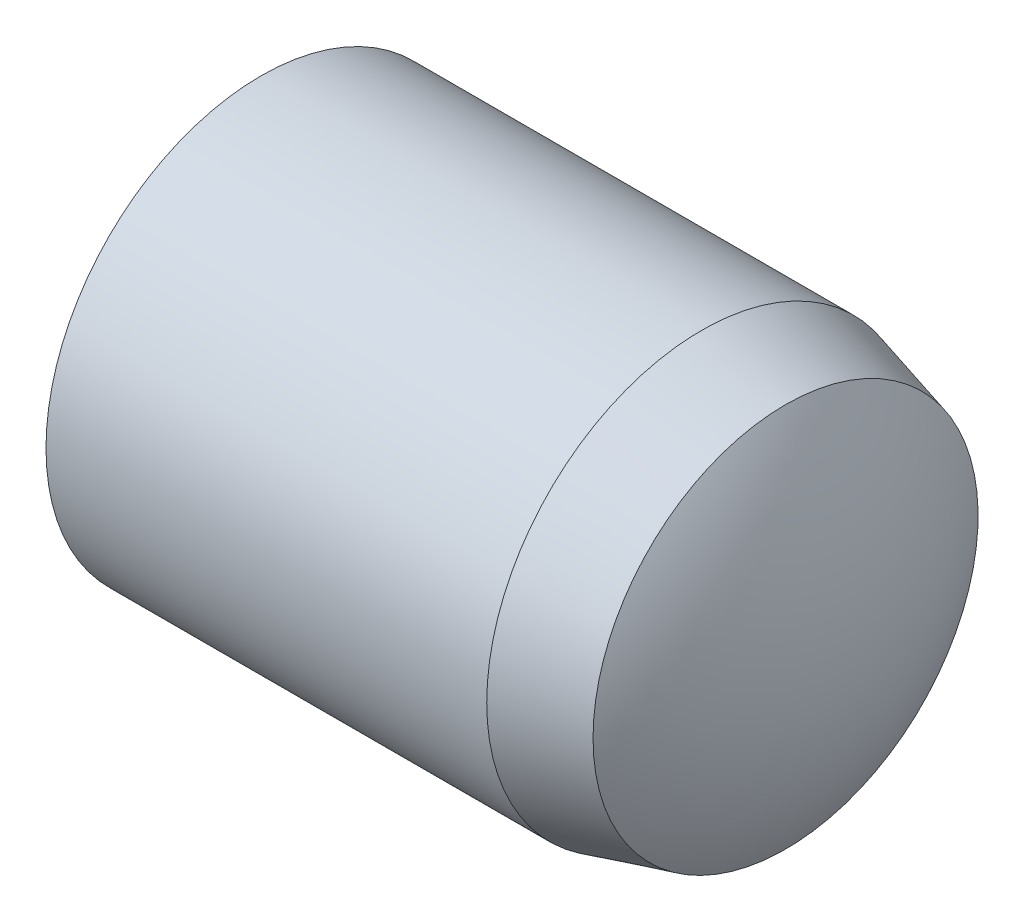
ISO-10303-21;
HEADER;
FILE_DESCRIPTION(('STEP AP214'),'2;1');
FILE_NAME('part.step','',(''),(''),'','','');
FILE_SCHEMA(('AUTOMOTIVE_DESIGN { 1 0 10303 214 1 1 1 1 }'));
ENDSEC;
DATA;
#1=APPLICATION_CONTEXT('core data for automotive mechanical design processes');
#2=APPLICATION_PROTOCOL_DEFINITION('international standard','automotive_design',2000,#1);
#3=PRODUCT_CONTEXT('',#1,'mechanical');
#4=PRODUCT('Part','Part','',(#3));
#5=PRODUCT_RELATED_PRODUCT_CATEGORY('part','',(#4));
#6=PRODUCT_DEFINITION_FORMATION('','',#4);
#7=PRODUCT_DEFINITION_CONTEXT('part definition',#1,'design');
#8=PRODUCT_DEFINITION('design','',#6,#7);
#9=PRODUCT_DEFINITION_SHAPE('','',#8);
#10=(LENGTH_UNIT() NAMED_UNIT(*) SI_UNIT(.MILLI.,.METRE.));
#11=(NAMED_UNIT(*) PLANE_ANGLE_UNIT() SI_UNIT($,.RADIAN.));
#12=(NAMED_UNIT(*) SI_UNIT($,.STERADIAN.) SOLID_ANGLE_UNIT());
#13=UNCERTAINTY_MEASURE_WITH_UNIT(LENGTH_MEASURE(1.E-05),#10,'distance_accuracy_value','');
#14=(GEOMETRIC_REPRESENTATION_CONTEXT(3) GLOBAL_UNCERTAINTY_ASSIGNED_CONTEXT((#13)) GLOBAL_UNIT_ASSIGNED_CONTEXT((#10,
#11,#12)) REPRESENTATION_CONTEXT('',''));
#15=CARTESIAN_POINT('',(0.,0.,0.));
#16=DIRECTION('',(0.,0.,1.));
#17=DIRECTION('',(1.,0.,0.));
#18=AXIS2_PLACEMENT_3D('',#15,#16,#17);
#19=CARTESIAN_POINT('',(-5.99999999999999,0.,0.));
#20=DIRECTION('',(1.,0.,0.));
#21=DIRECTION('',(0.,0.,-1.));
#22=AXIS2_PLACEMENT_3D('',#19,#20,#21);
#23=CYLINDRICAL_SURFACE('',#22,4.);
#24=CARTESIAN_POINT('',(3.4,0.,0.));
#25=DIRECTION('',(-1.,0.,0.));
#26=DIRECTION('',(0.,0.,1.));
#27=AXIS2_PLACEMENT_3D('',#24,#25,#26);
#28=CIRCLE('',#27,3.99999999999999);
#29=CARTESIAN_POINT('',(3.4,0.,3.99999999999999));
#30=VERTEX_POINT('',#29);
#31=EDGE_CURVE('E11',#30,#30,#28,.T.);
#32=ORIENTED_EDGE('',*,*,#31,.T.);
#33=EDGE_LOOP('',(#32));
#34=FACE_BOUND('',#33,.T.);
#35=CARTESIAN_POINT('',(-4.8,0.,0.));
#36=DIRECTION('',(-1.,0.,0.));
#37=DIRECTION('',(0.,0.,1.));
#38=AXIS2_PLACEMENT_3D('',#35,#36,#37);
#39=CIRCLE('',#38,4.);
#40=CARTESIAN_POINT('',(-4.8,0.,4.));
#41=VERTEX_POINT('',#40);
#42=EDGE_CURVE('E65',#41,#41,#39,.T.);
#43=ORIENTED_EDGE('',*,*,#42,.F.);
#44=EDGE_LOOP('',(#43));
#45=FACE_BOUND('',#44,.T.);
#46=ADVANCED_FACE('F42',(#34,#45),#23,.T.);
#47=CARTESIAN_POINT('',(3.4,0.,0.));
#48=DIRECTION('',(-1.,0.,0.));
#49=DIRECTION('',(0.,0.,1.));
#50=AXIS2_PLACEMENT_3D('',#47,#48,#49);
#51=CONICAL_SURFACE('',#50,3.99999999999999,0.26179938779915);
#52=CARTESIAN_POINT('',(4.96000000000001,0.,0.));
#53=DIRECTION('',(-1.,0.,0.));
#54=DIRECTION('',(0.,0.,1.));
#55=AXIS2_PLACEMENT_3D('',#52,#53,#54);
#56=CIRCLE('',#55,3.58199925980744);
#57=CARTESIAN_POINT('',(4.96000000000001,0.,3.58199925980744));
#58=VERTEX_POINT('',#57);
#59=EDGE_CURVE('E50',#58,#58,#56,.T.);
#60=ORIENTED_EDGE('',*,*,#59,.T.);
#61=EDGE_LOOP('',(#60));
#62=FACE_BOUND('',#61,.T.);
#63=ORIENTED_EDGE('',*,*,#31,.F.);
#64=EDGE_LOOP('',(#63));
#65=FACE_BOUND('',#64,.T.);
#66=ADVANCED_FACE('F73',(#62,#65),#51,.T.);
#67=CARTESIAN_POINT('',(-0.688614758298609,0.,0.));
#68=DIRECTION('',(-1.,0.,0.));
#69=DIRECTION('',(0.,1.,0.));
#70=AXIS2_PLACEMENT_3D('',#67,#68,#69);
#71=SPHERICAL_SURFACE('',#70,6.6886147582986);
#72=CARTESIAN_POINT('',(5.99999999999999,0.,0.));
#73=VERTEX_POINT('',#72);
#74=VERTEX_LOOP('',#73);
#75=FACE_BOUND('',#74,.T.);
#76=ORIENTED_EDGE('',*,*,#59,.F.);
#77=EDGE_LOOP('',(#76));
#78=FACE_BOUND('',#77,.T.);
#79=ADVANCED_FACE('F61',(#75,#78),#71,.T.);
#80=CARTESIAN_POINT('',(1.26666666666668,0.,0.));
#81=DIRECTION('',(-1.,0.,0.));
#82=DIRECTION('',(0.,1.,0.));
#83=AXIS2_PLACEMENT_3D('',#80,#81,#82);
#84=SPHERICAL_SURFACE('',#83,7.26666666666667);
#85=CARTESIAN_POINT('',(-5.99999999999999,0.,0.));
#86=VERTEX_POINT('',#85);
#87=VERTEX_LOOP('',#86);
#88=FACE_BOUND('',#87,.T.);
#89=ORIENTED_EDGE('',*,*,#42,.T.);
#90=EDGE_LOOP('',(#89));
#91=FACE_BOUND('',#90,.T.);
#92=ADVANCED_FACE('F58',(#88,#91),#84,.T.);
#93=CLOSED_SHELL('',(#46,#66,#79,#92));
#94=MANIFOLD_SOLID_BREP('B2',#93);
#95=ADVANCED_BREP_SHAPE_REPRESENTATION('',(#18,#94),#14);
#96=SHAPE_DEFINITION_REPRESENTATION(#9,#95);
ENDSEC;
END-ISO-10303-21;
